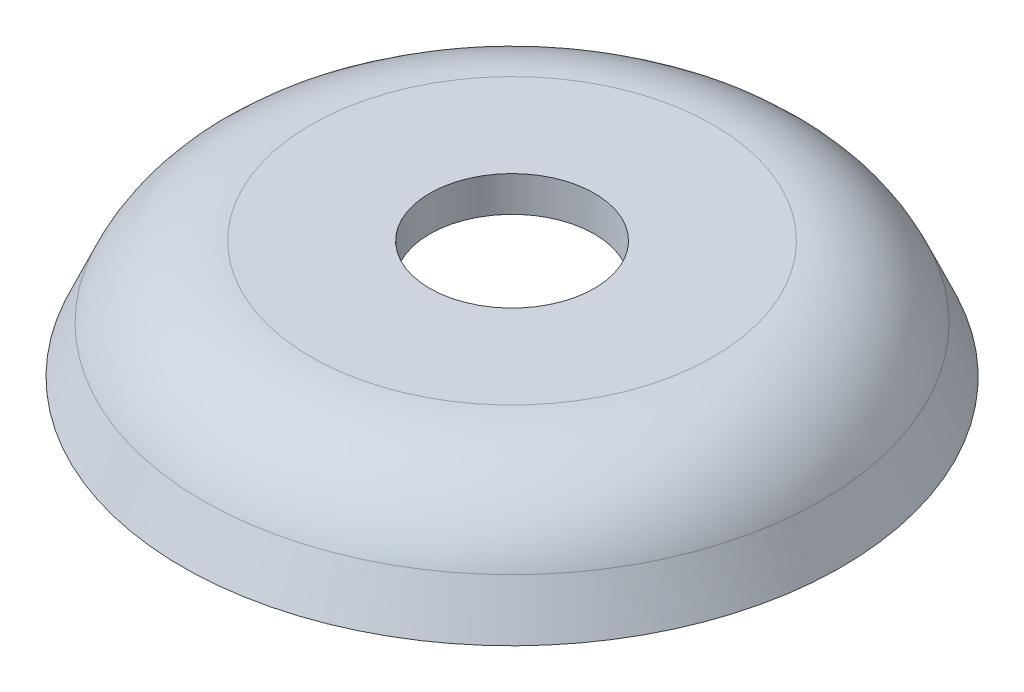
from build123d import *

# Parameters (mm, degrees)
SKETCH2_R      = 3.5
EXTRUDE1_DEPTH = 21.575707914


with BuildPart() as part:
    # Sketch1 → Revolve 290 (revolve)
    with BuildSketch(Plane.XY, mode=Mode.PRIVATE) as revolve_290_sk:
        with BuildLine():
            Line((0, 0), (8.54459045, 0))
            ThreePointArc((8.54459045, 0), (11.283236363, -0.816721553), (13.127197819, -3.000072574))
            Line((13.127197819, -3.000072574), (14, -5))
            Line((14, -5), (12.625217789, -5.599978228))
            Line((12.625217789, -5.599978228), (11.752415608, -3.600050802))
            ThreePointArc((11.752415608, -3.600050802), (10.461642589, -2.071705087), (8.54459045, -1.5))
            Line((8.54459045, -1.5), (0, -1.5))
            Line((0, -1.5), (0, 0))
        make_face()
    revolve(revolve_290_sk.sketch.rotate(Axis((0, 0, 0), (0, 1, 0)), 90), axis=Axis((0, 0, 0), (0, 1, 0)))

    # Sketch2 → Extrude1 (cut, through all)
    with BuildSketch(Plane(origin=(0, 0, 0), x_dir=(1, 0, 0), z_dir=(0, 1, 0))):
        with Locations(Location((0, 0, 0), (0, 0, 270))):
            Circle(SKETCH2_R)
    extrude(amount=-EXTRUDE1_DEPTH, mode=Mode.SUBTRACT)


solid = part.part
